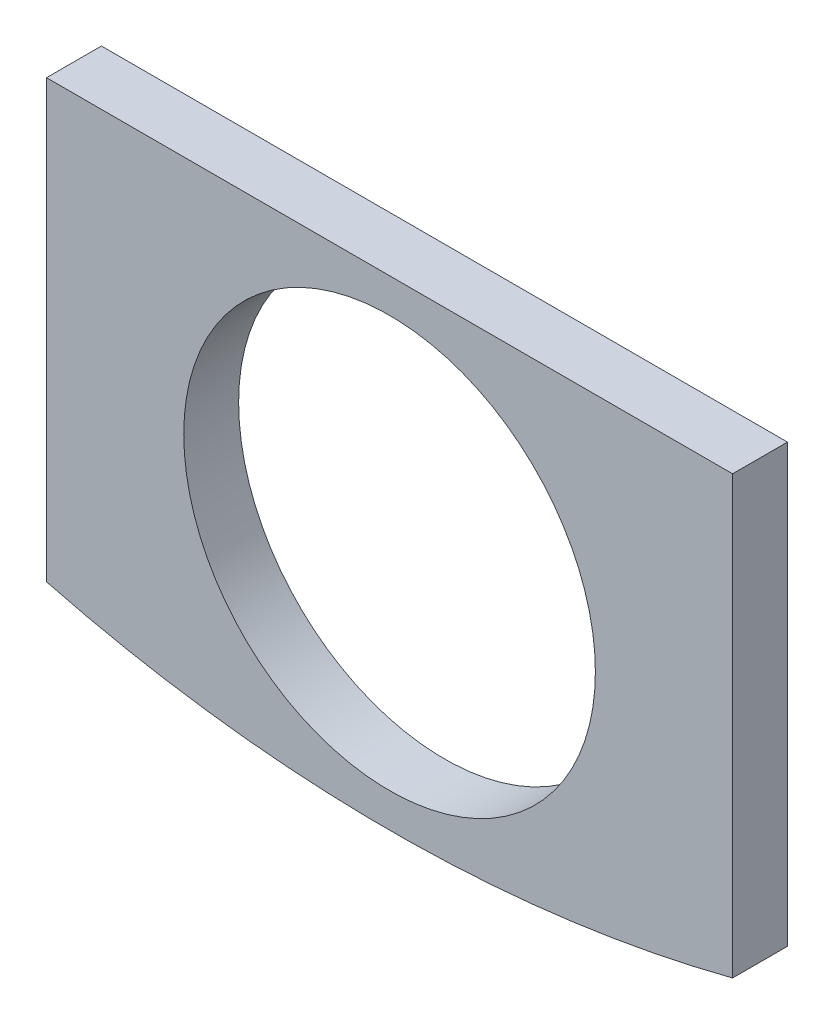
ISO-10303-21;
HEADER;
FILE_DESCRIPTION(('STEP AP214'),'2;1');
FILE_NAME('part.step','',(''),(''),'','','');
FILE_SCHEMA(('AUTOMOTIVE_DESIGN { 1 0 10303 214 1 1 1 1 }'));
ENDSEC;
DATA;
#1=APPLICATION_CONTEXT('core data for automotive mechanical design processes');
#2=APPLICATION_PROTOCOL_DEFINITION('international standard','automotive_design',2000,#1);
#3=PRODUCT_CONTEXT('',#1,'mechanical');
#4=PRODUCT('Part','Part','',(#3));
#5=PRODUCT_RELATED_PRODUCT_CATEGORY('part','',(#4));
#6=PRODUCT_DEFINITION_FORMATION('','',#4);
#7=PRODUCT_DEFINITION_CONTEXT('part definition',#1,'design');
#8=PRODUCT_DEFINITION('design','',#6,#7);
#9=PRODUCT_DEFINITION_SHAPE('','',#8);
#10=(LENGTH_UNIT() NAMED_UNIT(*) SI_UNIT(.MILLI.,.METRE.));
#11=(NAMED_UNIT(*) PLANE_ANGLE_UNIT() SI_UNIT($,.RADIAN.));
#12=(NAMED_UNIT(*) SI_UNIT($,.STERADIAN.) SOLID_ANGLE_UNIT());
#13=UNCERTAINTY_MEASURE_WITH_UNIT(LENGTH_MEASURE(1.E-05),#10,'distance_accuracy_value','');
#14=(GEOMETRIC_REPRESENTATION_CONTEXT(3) GLOBAL_UNCERTAINTY_ASSIGNED_CONTEXT((#13)) GLOBAL_UNIT_ASSIGNED_CONTEXT((#10,
#11,#12)) REPRESENTATION_CONTEXT('',''));
#15=CARTESIAN_POINT('',(0.,0.,0.));
#16=DIRECTION('',(0.,0.,1.));
#17=DIRECTION('',(1.,0.,0.));
#18=AXIS2_PLACEMENT_3D('',#15,#16,#17);
#19=CARTESIAN_POINT('',(25.,3.17541634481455,4.));
#20=DIRECTION('',(-1.,0.,0.));
#21=DIRECTION('',(0.,0.,1.));
#22=AXIS2_PLACEMENT_3D('',#19,#20,#21);
#23=PLANE('',#22);
#24=DIRECTION('',(0.,1.,0.));
#25=VECTOR('',#24,1.);
#26=CARTESIAN_POINT('',(25.,3.17541634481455,0.));
#27=LINE('',#26,#25);
#28=CARTESIAN_POINT('',(25.,3.17541634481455,0.));
#29=VERTEX_POINT('',#28);
#30=CARTESIAN_POINT('',(25.,35.,0.));
#31=VERTEX_POINT('',#30);
#32=EDGE_CURVE('E77',#29,#31,#27,.T.);
#33=ORIENTED_EDGE('',*,*,#32,.T.);
#34=DIRECTION('',(0.,0.,-1.));
#35=VECTOR('',#34,1.);
#36=CARTESIAN_POINT('',(25.,35.,4.));
#37=LINE('',#36,#35);
#38=CARTESIAN_POINT('',(25.,35.,4.));
#39=VERTEX_POINT('',#38);
#40=EDGE_CURVE('E11',#39,#31,#37,.T.);
#41=ORIENTED_EDGE('',*,*,#40,.F.);
#42=DIRECTION('',(0.,1.,0.));
#43=VECTOR('',#42,1.);
#44=CARTESIAN_POINT('',(25.,3.17541634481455,4.));
#45=LINE('',#44,#43);
#46=CARTESIAN_POINT('',(25.,3.17541634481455,4.));
#47=VERTEX_POINT('',#46);
#48=EDGE_CURVE('E100',#47,#39,#45,.T.);
#49=ORIENTED_EDGE('',*,*,#48,.F.);
#50=DIRECTION('',(0.,0.,-1.));
#51=VECTOR('',#50,1.);
#52=CARTESIAN_POINT('',(25.,3.17541634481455,4.));
#53=LINE('',#52,#51);
#54=EDGE_CURVE('E89',#47,#29,#53,.T.);
#55=ORIENTED_EDGE('',*,*,#54,.T.);
#56=EDGE_LOOP('',(#33,#41,#49,#55));
#57=FACE_BOUND('',#56,.T.);
#58=ADVANCED_FACE('F33',(#57),#23,.F.);
#59=CARTESIAN_POINT('',(-25.,35.,4.));
#60=DIRECTION('',(0.,-1.,0.));
#61=DIRECTION('',(0.,0.,-1.));
#62=AXIS2_PLACEMENT_3D('',#59,#60,#61);
#63=PLANE('',#62);
#64=DIRECTION('',(-1.,0.,0.));
#65=VECTOR('',#64,1.);
#66=CARTESIAN_POINT('',(-25.,35.,0.));
#67=LINE('',#66,#65);
#68=CARTESIAN_POINT('',(-25.,35.,0.));
#69=VERTEX_POINT('',#68);
#70=EDGE_CURVE('E73',#31,#69,#67,.T.);
#71=ORIENTED_EDGE('',*,*,#70,.T.);
#72=DIRECTION('',(0.,0.,-1.));
#73=VECTOR('',#72,1.);
#74=CARTESIAN_POINT('',(-25.,35.,4.));
#75=LINE('',#74,#73);
#76=CARTESIAN_POINT('',(-25.,35.,4.));
#77=VERTEX_POINT('',#76);
#78=EDGE_CURVE('E40',#77,#69,#75,.T.);
#79=ORIENTED_EDGE('',*,*,#78,.F.);
#80=DIRECTION('',(-1.,0.,0.));
#81=VECTOR('',#80,1.);
#82=CARTESIAN_POINT('',(-25.,35.,4.));
#83=LINE('',#82,#81);
#84=EDGE_CURVE('E85',#39,#77,#83,.T.);
#85=ORIENTED_EDGE('',*,*,#84,.F.);
#86=ORIENTED_EDGE('',*,*,#40,.T.);
#87=EDGE_LOOP('',(#71,#79,#85,#86));
#88=FACE_BOUND('',#87,.T.);
#89=ADVANCED_FACE('F84',(#88),#63,.F.);
#90=CARTESIAN_POINT('',(-25.,3.17541634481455,4.));
#91=DIRECTION('',(1.,0.,0.));
#92=DIRECTION('',(0.,0.,-1.));
#93=AXIS2_PLACEMENT_3D('',#90,#91,#92);
#94=PLANE('',#93);
#95=DIRECTION('',(0.,-1.,0.));
#96=VECTOR('',#95,1.);
#97=CARTESIAN_POINT('',(-25.,3.17541634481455,0.));
#98=LINE('',#97,#96);
#99=CARTESIAN_POINT('',(-25.,3.17541634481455,0.));
#100=VERTEX_POINT('',#99);
#101=EDGE_CURVE('E78',#69,#100,#98,.T.);
#102=ORIENTED_EDGE('',*,*,#101,.T.);
#103=DIRECTION('',(0.,0.,-1.));
#104=VECTOR('',#103,1.);
#105=CARTESIAN_POINT('',(-25.,3.17541634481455,4.));
#106=LINE('',#105,#104);
#107=CARTESIAN_POINT('',(-25.,3.17541634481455,4.));
#108=VERTEX_POINT('',#107);
#109=EDGE_CURVE('E106',#108,#100,#106,.T.);
#110=ORIENTED_EDGE('',*,*,#109,.F.);
#111=DIRECTION('',(0.,-1.,0.));
#112=VECTOR('',#111,1.);
#113=CARTESIAN_POINT('',(-25.,3.17541634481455,4.));
#114=LINE('',#113,#112);
#115=EDGE_CURVE('E52',#77,#108,#114,.T.);
#116=ORIENTED_EDGE('',*,*,#115,.F.);
#117=ORIENTED_EDGE('',*,*,#78,.T.);
#118=EDGE_LOOP('',(#102,#110,#116,#117));
#119=FACE_BOUND('',#118,.T.);
#120=ADVANCED_FACE('F109',(#119),#94,.F.);
#121=CARTESIAN_POINT('',(0.,100.,4.));
#122=DIRECTION('',(0.,0.,-1.));
#123=DIRECTION('',(-1.,0.,0.));
#124=AXIS2_PLACEMENT_3D('',#121,#122,#123);
#125=CYLINDRICAL_SURFACE('',#124,100.);
#126=CARTESIAN_POINT('',(0.,100.,0.));
#127=DIRECTION('',(0.,0.,1.));
#128=DIRECTION('',(1.,0.,0.));
#129=AXIS2_PLACEMENT_3D('',#126,#127,#128);
#130=CIRCLE('',#129,100.);
#131=EDGE_CURVE('E98',#100,#29,#130,.T.);
#132=ORIENTED_EDGE('',*,*,#131,.T.);
#133=ORIENTED_EDGE('',*,*,#54,.F.);
#134=CARTESIAN_POINT('',(0.,100.,4.));
#135=DIRECTION('',(0.,0.,1.));
#136=DIRECTION('',(1.,0.,0.));
#137=AXIS2_PLACEMENT_3D('',#134,#135,#136);
#138=CIRCLE('',#137,100.);
#139=EDGE_CURVE('E47',#108,#47,#138,.T.);
#140=ORIENTED_EDGE('',*,*,#139,.F.);
#141=ORIENTED_EDGE('',*,*,#109,.T.);
#142=EDGE_LOOP('',(#132,#133,#140,#141));
#143=FACE_BOUND('',#142,.T.);
#144=ADVANCED_FACE('F111',(#143),#125,.T.);
#145=CARTESIAN_POINT('',(0.,100.,4.));
#146=DIRECTION('',(0.,0.,1.));
#147=DIRECTION('',(1.,0.,0.));
#148=AXIS2_PLACEMENT_3D('',#145,#146,#147);
#149=PLANE('',#148);
#150=CARTESIAN_POINT('',(0.,17.5,4.));
#151=DIRECTION('',(0.,0.,1.));
#152=DIRECTION('',(1.,0.,0.));
#153=AXIS2_PLACEMENT_3D('',#150,#151,#152);
#154=CIRCLE('',#153,15.);
#155=CARTESIAN_POINT('',(15.,17.5,4.));
#156=VERTEX_POINT('',#155);
#157=EDGE_CURVE('E93',#156,#156,#154,.T.);
#158=ORIENTED_EDGE('',*,*,#157,.F.);
#159=EDGE_LOOP('',(#158));
#160=FACE_BOUND('',#159,.T.);
#161=ORIENTED_EDGE('',*,*,#48,.T.);
#162=ORIENTED_EDGE('',*,*,#84,.T.);
#163=ORIENTED_EDGE('',*,*,#115,.T.);
#164=ORIENTED_EDGE('',*,*,#139,.T.);
#165=EDGE_LOOP('',(#161,#162,#163,#164));
#166=FACE_BOUND('',#165,.T.);
#167=ADVANCED_FACE('F112',(#160,#166),#149,.T.);
#168=CARTESIAN_POINT('',(0.,100.,0.));
#169=DIRECTION('',(0.,0.,1.));
#170=DIRECTION('',(1.,0.,0.));
#171=AXIS2_PLACEMENT_3D('',#168,#169,#170);
#172=PLANE('',#171);
#173=CARTESIAN_POINT('',(0.,17.5,0.));
#174=DIRECTION('',(0.,0.,1.));
#175=DIRECTION('',(1.,0.,0.));
#176=AXIS2_PLACEMENT_3D('',#173,#174,#175);
#177=CIRCLE('',#176,15.);
#178=CARTESIAN_POINT('',(15.,17.5,0.));
#179=VERTEX_POINT('',#178);
#180=EDGE_CURVE('E90',#179,#179,#177,.T.);
#181=ORIENTED_EDGE('',*,*,#180,.T.);
#182=EDGE_LOOP('',(#181));
#183=FACE_BOUND('',#182,.T.);
#184=ORIENTED_EDGE('',*,*,#32,.F.);
#185=ORIENTED_EDGE('',*,*,#131,.F.);
#186=ORIENTED_EDGE('',*,*,#101,.F.);
#187=ORIENTED_EDGE('',*,*,#70,.F.);
#188=EDGE_LOOP('',(#184,#185,#186,#187));
#189=FACE_BOUND('',#188,.T.);
#190=ADVANCED_FACE('F74',(#183,#189),#172,.F.);
#191=CARTESIAN_POINT('',(0.,17.5,0.));
#192=DIRECTION('',(0.,0.,1.));
#193=DIRECTION('',(1.,0.,0.));
#194=AXIS2_PLACEMENT_3D('',#191,#192,#193);
#195=CYLINDRICAL_SURFACE('',#194,15.);
#196=ORIENTED_EDGE('',*,*,#180,.F.);
#197=EDGE_LOOP('',(#196));
#198=FACE_BOUND('',#197,.T.);
#199=ORIENTED_EDGE('',*,*,#157,.T.);
#200=EDGE_LOOP('',(#199));
#201=FACE_BOUND('',#200,.T.);
#202=ADVANCED_FACE('F120',(#198,#201),#195,.F.);
#203=CLOSED_SHELL('',(#58,#89,#120,#144,#167,#190,#202));
#204=MANIFOLD_SOLID_BREP('B2',#203);
#205=ADVANCED_BREP_SHAPE_REPRESENTATION('',(#18,#204),#14);
#206=SHAPE_DEFINITION_REPRESENTATION(#9,#205);
ENDSEC;
END-ISO-10303-21;
